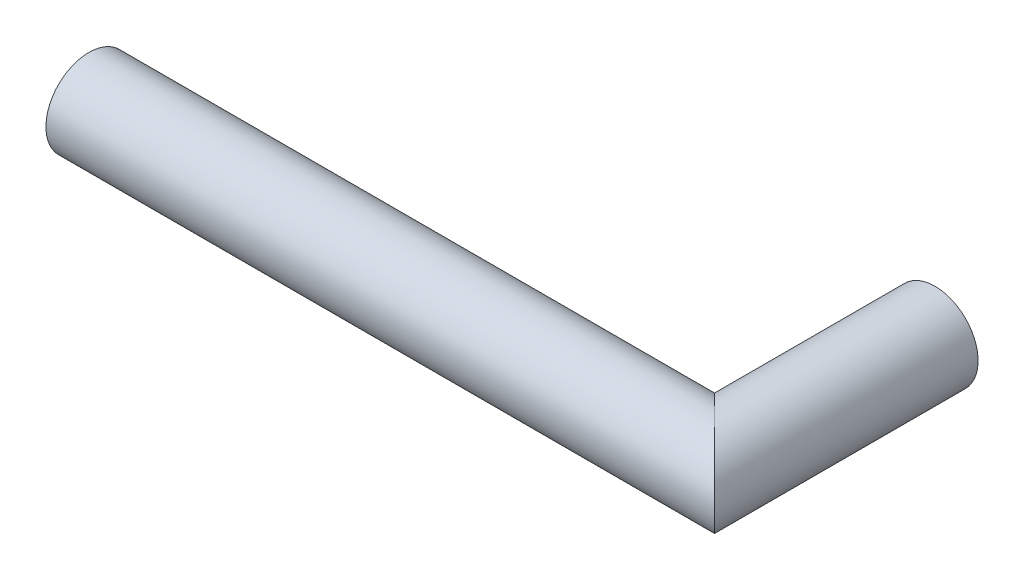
from build123d import *

# Parameters (mm, degrees)
CROQUIS2_R   = 6
CROQUIS2_R_2 = 5


with BuildPart() as part:
    # Barrer2: sweep along a path in Croquis1
    with BuildLine(Plane(origin=(0, 0, 0), x_dir=(1, 0, 0), z_dir=(0, 1, 0))) as barrer2_path:
        Line((0, 0), (87.25, 0))
        Line((87.25, 0), (87.25, 30.751320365))
    # Croquis2 → Barrer2 (sweep)
    with BuildSketch(Plane(origin=(0, 0, 0), x_dir=(0, 0, -1), z_dir=(1, 0, 0))):
        Circle(CROQUIS2_R)
        Circle(CROQUIS2_R_2, mode=Mode.SUBTRACT)
    sweep(path=barrer2_path.line, transition=Transition.RIGHT)


solid = part.part
